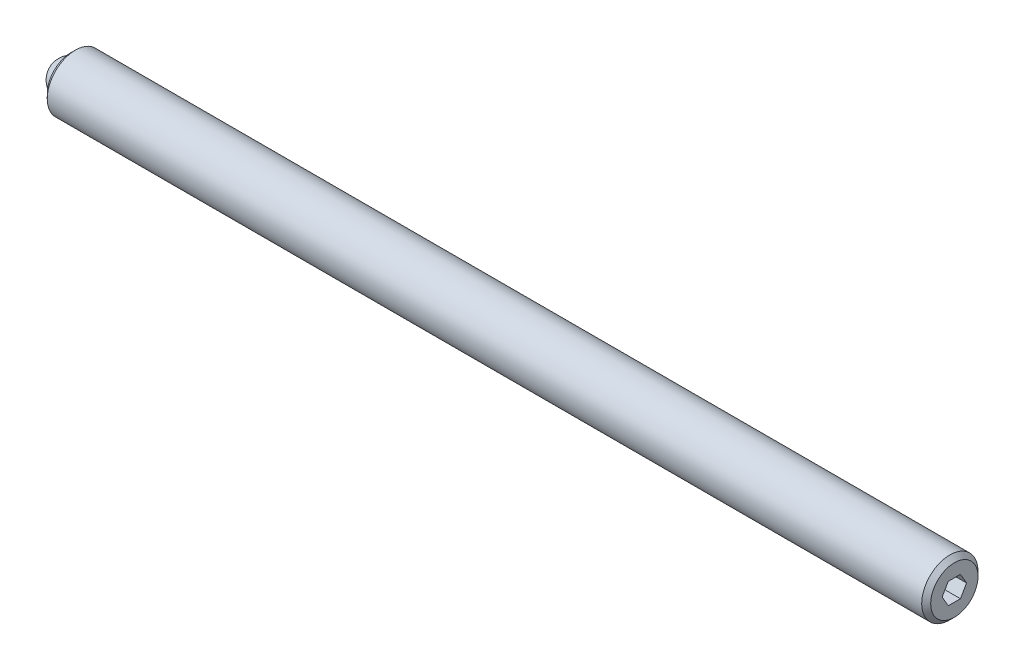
ISO-10303-21;
HEADER;
FILE_DESCRIPTION(('STEP AP214'),'2;1');
FILE_NAME('part.step','',(''),(''),'','','');
FILE_SCHEMA(('AUTOMOTIVE_DESIGN { 1 0 10303 214 1 1 1 1 }'));
ENDSEC;
DATA;
#1=APPLICATION_CONTEXT('core data for automotive mechanical design processes');
#2=APPLICATION_PROTOCOL_DEFINITION('international standard','automotive_design',2000,#1);
#3=PRODUCT_CONTEXT('',#1,'mechanical');
#4=PRODUCT('Part','Part','',(#3));
#5=PRODUCT_RELATED_PRODUCT_CATEGORY('part','',(#4));
#6=PRODUCT_DEFINITION_FORMATION('','',#4);
#7=PRODUCT_DEFINITION_CONTEXT('part definition',#1,'design');
#8=PRODUCT_DEFINITION('design','',#6,#7);
#9=PRODUCT_DEFINITION_SHAPE('','',#8);
#10=(LENGTH_UNIT() NAMED_UNIT(*) SI_UNIT(.MILLI.,.METRE.));
#11=(NAMED_UNIT(*) PLANE_ANGLE_UNIT() SI_UNIT($,.RADIAN.));
#12=(NAMED_UNIT(*) SI_UNIT($,.STERADIAN.) SOLID_ANGLE_UNIT());
#13=UNCERTAINTY_MEASURE_WITH_UNIT(LENGTH_MEASURE(1.E-05),#10,'distance_accuracy_value','');
#14=(GEOMETRIC_REPRESENTATION_CONTEXT(3) GLOBAL_UNCERTAINTY_ASSIGNED_CONTEXT((#13)) GLOBAL_UNIT_ASSIGNED_CONTEXT((#10,
#11,#12)) REPRESENTATION_CONTEXT('',''));
#15=CARTESIAN_POINT('',(0.,0.,0.));
#16=DIRECTION('',(0.,0.,1.));
#17=DIRECTION('',(1.,0.,0.));
#18=AXIS2_PLACEMENT_3D('',#15,#16,#17);
#19=CARTESIAN_POINT('',(0.,0.,0.));
#20=DIRECTION('',(0.,-1.,0.));
#21=DIRECTION('',(0.,0.,1.));
#22=AXIS2_PLACEMENT_3D('',#19,#20,#21);
#23=SPHERICAL_SURFACE('',#22,1.984375);
#24=CARTESIAN_POINT('',(0.,-1.984375,0.));
#25=VERTEX_POINT('',#24);
#26=VERTEX_LOOP('',#25);
#27=FACE_BOUND('',#26,.T.);
#28=ADVANCED_FACE('F41',(#27),#23,.T.);
#29=CLOSED_SHELL('',(#28));
#30=MANIFOLD_SOLID_BREP('B2',#29);
#31=CARTESIAN_POINT('',(99.615625,0.,0.));
#32=DIRECTION('',(-1.,0.,0.));
#33=DIRECTION('',(0.,0.,1.));
#34=AXIS2_PLACEMENT_3D('',#31,#32,#33);
#35=CYLINDRICAL_SURFACE('',#34,3.175);
#36=CARTESIAN_POINT('',(99.107625,0.,0.));
#37=DIRECTION('',(1.,0.,0.));
#38=DIRECTION('',(0.,0.,-1.));
#39=AXIS2_PLACEMENT_3D('',#36,#37,#38);
#40=CIRCLE('',#39,3.175);
#41=CARTESIAN_POINT('',(99.107625,0.,3.175));
#42=VERTEX_POINT('',#41);
#43=EDGE_CURVE('E39',#42,#42,#40,.F.);
#44=CARTESIAN_POINT('',(0.508000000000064,0.,0.));
#45=DIRECTION('',(1.,0.,0.));
#46=DIRECTION('',(0.,0.,-1.));
#47=AXIS2_PLACEMENT_3D('',#44,#45,#46);
#48=CIRCLE('',#47,3.175);
#49=CARTESIAN_POINT('',(0.508000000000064,0.,3.175));
#50=VERTEX_POINT('',#49);
#51=EDGE_CURVE('E157',#50,#50,#48,.T.);
#52=CARTESIAN_POINT('',(99.107625,0.,3.175));
#53=CARTESIAN_POINT('',(98.0805455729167,0.,3.175));
#54=CARTESIAN_POINT('',(97.0534661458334,0.,3.175));
#55=CARTESIAN_POINT('',(94.9993072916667,0.,3.175));
#56=CARTESIAN_POINT('',(93.9722278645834,0.,3.175));
#57=CARTESIAN_POINT('',(91.9180690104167,0.,3.175));
#58=CARTESIAN_POINT('',(90.8909895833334,0.,3.175));
#59=CARTESIAN_POINT('',(88.8368307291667,0.,3.175));
#60=CARTESIAN_POINT('',(87.8097513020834,0.,3.175));
#61=CARTESIAN_POINT('',(85.7555924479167,0.,3.175));
#62=CARTESIAN_POINT('',(84.7285130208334,0.,3.175));
#63=CARTESIAN_POINT('',(82.6743541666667,0.,3.175));
#64=CARTESIAN_POINT('',(81.6472747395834,0.,3.175));
#65=CARTESIAN_POINT('',(79.5931158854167,0.,3.175));
#66=CARTESIAN_POINT('',(78.5660364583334,0.,3.175));
#67=CARTESIAN_POINT('',(76.5118776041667,0.,3.175));
#68=CARTESIAN_POINT('',(75.4847981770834,0.,3.175));
#69=CARTESIAN_POINT('',(73.4306393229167,0.,3.175));
#70=CARTESIAN_POINT('',(72.4035598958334,0.,3.175));
#71=CARTESIAN_POINT('',(70.3494010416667,0.,3.175));
#72=CARTESIAN_POINT('',(69.3223216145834,0.,3.175));
#73=CARTESIAN_POINT('',(67.2681627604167,0.,3.175));
#74=CARTESIAN_POINT('',(66.2410833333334,0.,3.175));
#75=CARTESIAN_POINT('',(64.1869244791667,0.,3.175));
#76=CARTESIAN_POINT('',(63.1598450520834,0.,3.175));
#77=CARTESIAN_POINT('',(61.1056861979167,0.,3.175));
#78=CARTESIAN_POINT('',(60.0786067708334,0.,3.175));
#79=CARTESIAN_POINT('',(58.0244479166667,0.,3.175));
#80=CARTESIAN_POINT('',(56.9973684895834,0.,3.175));
#81=CARTESIAN_POINT('',(54.9432096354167,0.,3.175));
#82=CARTESIAN_POINT('',(53.9161302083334,0.,3.175));
#83=CARTESIAN_POINT('',(51.8619713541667,0.,3.175));
#84=CARTESIAN_POINT('',(50.8348919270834,0.,3.175));
#85=CARTESIAN_POINT('',(48.7807330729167,0.,3.175));
#86=CARTESIAN_POINT('',(47.7536536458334,0.,3.175));
#87=CARTESIAN_POINT('',(45.6994947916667,0.,3.175));
#88=CARTESIAN_POINT('',(44.6724153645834,0.,3.175));
#89=CARTESIAN_POINT('',(42.6182565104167,0.,3.175));
#90=CARTESIAN_POINT('',(41.5911770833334,0.,3.175));
#91=CARTESIAN_POINT('',(39.5370182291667,0.,3.175));
#92=CARTESIAN_POINT('',(38.5099388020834,0.,3.175));
#93=CARTESIAN_POINT('',(36.4557799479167,0.,3.175));
#94=CARTESIAN_POINT('',(35.4287005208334,0.,3.175));
#95=CARTESIAN_POINT('',(33.3745416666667,0.,3.175));
#96=CARTESIAN_POINT('',(32.3474622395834,0.,3.175));
#97=CARTESIAN_POINT('',(30.2933033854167,0.,3.175));
#98=CARTESIAN_POINT('',(29.2662239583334,0.,3.175));
#99=CARTESIAN_POINT('',(27.2120651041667,0.,3.175));
#100=CARTESIAN_POINT('',(26.1849856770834,0.,3.175));
#101=CARTESIAN_POINT('',(24.1308268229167,0.,3.175));
#102=CARTESIAN_POINT('',(23.1037473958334,0.,3.175));
#103=CARTESIAN_POINT('',(21.0495885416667,0.,3.175));
#104=CARTESIAN_POINT('',(20.0225091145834,0.,3.175));
#105=CARTESIAN_POINT('',(17.9683502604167,0.,3.175));
#106=CARTESIAN_POINT('',(16.9412708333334,0.,3.175));
#107=CARTESIAN_POINT('',(14.8871119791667,0.,3.175));
#108=CARTESIAN_POINT('',(13.8600325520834,0.,3.175));
#109=CARTESIAN_POINT('',(11.8058736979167,0.,3.175));
#110=CARTESIAN_POINT('',(10.7787942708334,0.,3.175));
#111=CARTESIAN_POINT('',(8.72463541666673,0.,3.175));
#112=CARTESIAN_POINT('',(7.69755598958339,0.,3.175));
#113=CARTESIAN_POINT('',(5.64339713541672,0.,3.175));
#114=CARTESIAN_POINT('',(4.61631770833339,0.,3.175));
#115=CARTESIAN_POINT('',(2.56215885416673,0.,3.175));
#116=CARTESIAN_POINT('',(1.5350794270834,0.,3.175));
#117=CARTESIAN_POINT('',(0.508000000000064,0.,3.175));
#118=B_SPLINE_CURVE_WITH_KNOTS('',3,(#52,#53,#54,#55,#56,#57,#58,#59,#60,#61,#62,#63,#64,#65,
#66,#67,#68,#69,#70,#71,#72,#73,#74,#75,#76,#77,#78,#79,#80,#81,#82,#83,#84,#85,#86,#87,#88,#89,
#90,#91,#92,#93,#94,#95,#96,#97,#98,#99,#100,#101,#102,#103,#104,#105,#106,#107,#108,#109,#110,
#111,#112,#113,#114,#115,#116,#117),.UNSPECIFIED.,.F.,.F.,(4,2,2,2,2,2,2,2,2,2,2,2,2,2,2,2,2,2,
2,2,2,2,2,2,2,2,2,2,2,2,2,2,4),(0.,3.08123828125,6.16247656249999,9.24371484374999,12.324953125,
15.40619140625,18.4874296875,21.56866796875,24.64990625,27.73114453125,30.8123828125,
33.89362109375,36.974859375,40.05609765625,43.1373359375,46.21857421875,49.2998125,
52.38105078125,55.4622890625,58.54352734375,61.624765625,64.70600390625,67.7872421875,
70.86848046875,73.94971875,77.03095703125,80.1121953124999,83.19343359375,86.274671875,
89.3559101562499,92.4371484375,95.51838671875,98.599625),.UNSPECIFIED.);
#119=EDGE_CURVE('BSEAM54',#42,#50,#118,.T.);
#120=ORIENTED_EDGE('',*,*,#43,.T.);
#121=ORIENTED_EDGE('',*,*,#51,.T.);
#122=ORIENTED_EDGE('',*,*,#119,.T.);
#123=ORIENTED_EDGE('',*,*,#119,.F.);
#124=EDGE_LOOP('',(#120,#122,#121,#123));
#125=FACE_BOUND('',#124,.T.);
#126=ADVANCED_FACE('F54',(#125),#35,.T.);
#127=CARTESIAN_POINT('',(99.615625,0.,0.));
#128=DIRECTION('',(1.,0.,0.));
#129=DIRECTION('',(0.,0.,-1.));
#130=AXIS2_PLACEMENT_3D('',#127,#128,#129);
#131=PLANE('',#130);
#132=DIRECTION('',(0.,0.866025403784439,-0.5));
#133=VECTOR('',#132,1.);
#134=CARTESIAN_POINT('',(99.615625,-1.190625,-0.687407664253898));
#135=LINE('',#134,#133);
#136=CARTESIAN_POINT('',(99.615625,-1.190625,-0.687407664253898));
#137=VERTEX_POINT('',#136);
#138=CARTESIAN_POINT('',(99.615625,0.,-1.3748153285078));
#139=VERTEX_POINT('',#138);
#140=EDGE_CURVE('E69',#137,#139,#135,.T.);
#141=ORIENTED_EDGE('',*,*,#140,.F.);
#142=DIRECTION('',(0.,0.,-1.));
#143=VECTOR('',#142,1.);
#144=CARTESIAN_POINT('',(99.615625,-1.190625,0.687407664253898));
#145=LINE('',#144,#143);
#146=CARTESIAN_POINT('',(99.615625,-1.190625,0.687407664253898));
#147=VERTEX_POINT('',#146);
#148=EDGE_CURVE('E153',#147,#137,#145,.T.);
#149=ORIENTED_EDGE('',*,*,#148,.F.);
#150=DIRECTION('',(0.,-0.866025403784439,-0.5));
#151=VECTOR('',#150,1.);
#152=CARTESIAN_POINT('',(99.615625,0.,1.3748153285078));
#153=LINE('',#152,#151);
#154=CARTESIAN_POINT('',(99.615625,0.,1.3748153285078));
#155=VERTEX_POINT('',#154);
#156=EDGE_CURVE('E151',#155,#147,#153,.T.);
#157=ORIENTED_EDGE('',*,*,#156,.F.);
#158=DIRECTION('',(0.,-0.866025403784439,0.5));
#159=VECTOR('',#158,1.);
#160=CARTESIAN_POINT('',(99.615625,1.190625,0.687407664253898));
#161=LINE('',#160,#159);
#162=CARTESIAN_POINT('',(99.615625,1.190625,0.687407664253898));
#163=VERTEX_POINT('',#162);
#164=EDGE_CURVE('E117',#163,#155,#161,.T.);
#165=ORIENTED_EDGE('',*,*,#164,.F.);
#166=DIRECTION('',(0.,0.,1.));
#167=VECTOR('',#166,1.);
#168=CARTESIAN_POINT('',(99.615625,1.190625,-0.687407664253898));
#169=LINE('',#168,#167);
#170=CARTESIAN_POINT('',(99.615625,1.190625,-0.687407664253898));
#171=VERTEX_POINT('',#170);
#172=EDGE_CURVE('E147',#171,#163,#169,.T.);
#173=ORIENTED_EDGE('',*,*,#172,.F.);
#174=DIRECTION('',(0.,0.866025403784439,0.5));
#175=VECTOR('',#174,1.);
#176=CARTESIAN_POINT('',(99.615625,0.,-1.3748153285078));
#177=LINE('',#176,#175);
#178=EDGE_CURVE('E143',#139,#171,#177,.T.);
#179=ORIENTED_EDGE('',*,*,#178,.F.);
#180=EDGE_LOOP('',(#141,#149,#157,#165,#173,#179));
#181=FACE_BOUND('',#180,.T.);
#182=CARTESIAN_POINT('',(99.615625,0.,0.));
#183=DIRECTION('',(1.,0.,0.));
#184=DIRECTION('',(0.,0.,-1.));
#185=AXIS2_PLACEMENT_3D('',#182,#183,#184);
#186=CIRCLE('',#185,2.66700000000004);
#187=CARTESIAN_POINT('',(99.615625,0.,-2.66700000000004));
#188=VERTEX_POINT('',#187);
#189=EDGE_CURVE('E62',#188,#188,#186,.T.);
#190=ORIENTED_EDGE('',*,*,#189,.T.);
#191=EDGE_LOOP('',(#190));
#192=FACE_BOUND('',#191,.T.);
#193=ADVANCED_FACE('F170',(#181,#192),#131,.T.);
#194=CARTESIAN_POINT('',(0.,0.,0.));
#195=DIRECTION('',(1.,0.,0.));
#196=DIRECTION('',(0.,0.,-1.));
#197=AXIS2_PLACEMENT_3D('',#194,#195,#196);
#198=PLANE('',#197);
#199=CARTESIAN_POINT('',(0.,0.,0.));
#200=DIRECTION('',(-1.,0.,0.));
#201=DIRECTION('',(0.,0.,1.));
#202=AXIS2_PLACEMENT_3D('',#199,#200,#201);
#203=CIRCLE('',#202,1.9812);
#204=CARTESIAN_POINT('',(0.,0.,1.9812));
#205=VERTEX_POINT('',#204);
#206=EDGE_CURVE('E225',#205,#205,#203,.T.);
#207=ORIENTED_EDGE('',*,*,#206,.F.);
#208=EDGE_LOOP('',(#207));
#209=FACE_BOUND('',#208,.T.);
#210=CARTESIAN_POINT('',(0.,0.,0.));
#211=DIRECTION('',(1.,0.,0.));
#212=DIRECTION('',(0.,0.,-1.));
#213=AXIS2_PLACEMENT_3D('',#210,#211,#212);
#214=CIRCLE('',#213,2.66699999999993);
#215=CARTESIAN_POINT('',(0.,0.,-2.66699999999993));
#216=VERTEX_POINT('',#215);
#217=EDGE_CURVE('E165',#216,#216,#214,.F.);
#218=ORIENTED_EDGE('',*,*,#217,.T.);
#219=EDGE_LOOP('',(#218));
#220=FACE_BOUND('',#219,.T.);
#221=ADVANCED_FACE('F182',(#209,#220),#198,.F.);
#222=CARTESIAN_POINT('',(0.508000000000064,0.,0.));
#223=DIRECTION('',(1.,0.,0.));
#224=DIRECTION('',(0.,0.,-1.));
#225=AXIS2_PLACEMENT_3D('',#222,#223,#224);
#226=CONICAL_SURFACE('',#225,3.175,0.785398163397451);
#227=ORIENTED_EDGE('',*,*,#217,.F.);
#228=EDGE_LOOP('',(#227));
#229=FACE_BOUND('',#228,.T.);
#230=ORIENTED_EDGE('',*,*,#51,.F.);
#231=EDGE_LOOP('',(#230));
#232=FACE_BOUND('',#231,.T.);
#233=ADVANCED_FACE('F174',(#229,#232),#226,.T.);
#234=CARTESIAN_POINT('',(99.615625,0.,0.));
#235=DIRECTION('',(-1.,0.,0.));
#236=DIRECTION('',(0.,0.,1.));
#237=AXIS2_PLACEMENT_3D('',#234,#235,#236);
#238=CONICAL_SURFACE('',#237,2.66700000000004,0.785398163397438);
#239=ORIENTED_EDGE('',*,*,#43,.F.);
#240=EDGE_LOOP('',(#239));
#241=FACE_BOUND('',#240,.T.);
#242=ORIENTED_EDGE('',*,*,#189,.F.);
#243=EDGE_LOOP('',(#242));
#244=FACE_BOUND('',#243,.T.);
#245=ADVANCED_FACE('F56',(#241,#244),#238,.T.);
#246=CARTESIAN_POINT('',(97.329625,-1.190625,-0.687407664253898));
#247=DIRECTION('',(0.,-0.5,-0.866025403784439));
#248=DIRECTION('',(0.,0.866025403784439,-0.5));
#249=AXIS2_PLACEMENT_3D('',#246,#247,#248);
#250=PLANE('',#249);
#251=ORIENTED_EDGE('',*,*,#140,.T.);
#252=DIRECTION('',(1.,0.,0.));
#253=VECTOR('',#252,1.);
#254=CARTESIAN_POINT('',(97.329625,0.,-1.3748153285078));
#255=LINE('',#254,#253);
#256=CARTESIAN_POINT('',(97.329625,0.,-1.3748153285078));
#257=VERTEX_POINT('',#256);
#258=EDGE_CURVE('E99',#257,#139,#255,.T.);
#259=ORIENTED_EDGE('',*,*,#258,.F.);
#260=DIRECTION('',(0.,0.866025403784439,-0.5));
#261=VECTOR('',#260,1.);
#262=CARTESIAN_POINT('',(97.329625,-1.190625,-0.687407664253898));
#263=LINE('',#262,#261);
#264=CARTESIAN_POINT('',(97.329625,-1.190625,-0.687407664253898));
#265=VERTEX_POINT('',#264);
#266=EDGE_CURVE('E155',#265,#257,#263,.T.);
#267=ORIENTED_EDGE('',*,*,#266,.F.);
#268=DIRECTION('',(1.,0.,0.));
#269=VECTOR('',#268,1.);
#270=CARTESIAN_POINT('',(97.329625,-1.190625,-0.687407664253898));
#271=LINE('',#270,#269);
#272=EDGE_CURVE('E77',#265,#137,#271,.T.);
#273=ORIENTED_EDGE('',*,*,#272,.T.);
#274=EDGE_LOOP('',(#251,#259,#267,#273));
#275=FACE_BOUND('',#274,.T.);
#276=ADVANCED_FACE('F173',(#275),#250,.F.);
#277=CARTESIAN_POINT('',(97.329625,-1.190625,0.687407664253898));
#278=DIRECTION('',(0.,-1.,0.));
#279=DIRECTION('',(0.,0.,-1.));
#280=AXIS2_PLACEMENT_3D('',#277,#278,#279);
#281=PLANE('',#280);
#282=ORIENTED_EDGE('',*,*,#148,.T.);
#283=ORIENTED_EDGE('',*,*,#272,.F.);
#284=DIRECTION('',(0.,0.,-1.));
#285=VECTOR('',#284,1.);
#286=CARTESIAN_POINT('',(97.329625,-1.190625,0.687407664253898));
#287=LINE('',#286,#285);
#288=CARTESIAN_POINT('',(97.329625,-1.190625,0.687407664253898));
#289=VERTEX_POINT('',#288);
#290=EDGE_CURVE('E129',#289,#265,#287,.T.);
#291=ORIENTED_EDGE('',*,*,#290,.F.);
#292=DIRECTION('',(1.,0.,0.));
#293=VECTOR('',#292,1.);
#294=CARTESIAN_POINT('',(97.329625,-1.190625,0.687407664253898));
#295=LINE('',#294,#293);
#296=EDGE_CURVE('E121',#289,#147,#295,.T.);
#297=ORIENTED_EDGE('',*,*,#296,.T.);
#298=EDGE_LOOP('',(#282,#283,#291,#297));
#299=FACE_BOUND('',#298,.T.);
#300=ADVANCED_FACE('F180',(#299),#281,.F.);
#301=CARTESIAN_POINT('',(97.329625,0.,1.3748153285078));
#302=DIRECTION('',(0.,-0.5,0.866025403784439));
#303=DIRECTION('',(0.,-0.866025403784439,-0.5));
#304=AXIS2_PLACEMENT_3D('',#301,#302,#303);
#305=PLANE('',#304);
#306=ORIENTED_EDGE('',*,*,#156,.T.);
#307=ORIENTED_EDGE('',*,*,#296,.F.);
#308=DIRECTION('',(0.,-0.866025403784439,-0.5));
#309=VECTOR('',#308,1.);
#310=CARTESIAN_POINT('',(97.329625,0.,1.3748153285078));
#311=LINE('',#310,#309);
#312=CARTESIAN_POINT('',(97.329625,0.,1.3748153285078));
#313=VERTEX_POINT('',#312);
#314=EDGE_CURVE('E125',#313,#289,#311,.T.);
#315=ORIENTED_EDGE('',*,*,#314,.F.);
#316=DIRECTION('',(1.,0.,0.));
#317=VECTOR('',#316,1.);
#318=CARTESIAN_POINT('',(97.329625,0.,1.3748153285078));
#319=LINE('',#318,#317);
#320=EDGE_CURVE('E110',#313,#155,#319,.T.);
#321=ORIENTED_EDGE('',*,*,#320,.T.);
#322=EDGE_LOOP('',(#306,#307,#315,#321));
#323=FACE_BOUND('',#322,.T.);
#324=ADVANCED_FACE('F126',(#323),#305,.F.);
#325=CARTESIAN_POINT('',(97.329625,1.190625,0.687407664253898));
#326=DIRECTION('',(0.,0.5,0.866025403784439));
#327=DIRECTION('',(0.,-0.866025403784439,0.5));
#328=AXIS2_PLACEMENT_3D('',#325,#326,#327);
#329=PLANE('',#328);
#330=ORIENTED_EDGE('',*,*,#164,.T.);
#331=ORIENTED_EDGE('',*,*,#320,.F.);
#332=DIRECTION('',(0.,-0.866025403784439,0.5));
#333=VECTOR('',#332,1.);
#334=CARTESIAN_POINT('',(97.329625,1.190625,0.687407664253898));
#335=LINE('',#334,#333);
#336=CARTESIAN_POINT('',(97.329625,1.190625,0.687407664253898));
#337=VERTEX_POINT('',#336);
#338=EDGE_CURVE('E114',#337,#313,#335,.T.);
#339=ORIENTED_EDGE('',*,*,#338,.F.);
#340=DIRECTION('',(1.,0.,0.));
#341=VECTOR('',#340,1.);
#342=CARTESIAN_POINT('',(97.329625,1.190625,0.687407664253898));
#343=LINE('',#342,#341);
#344=EDGE_CURVE('E122',#337,#163,#343,.T.);
#345=ORIENTED_EDGE('',*,*,#344,.T.);
#346=EDGE_LOOP('',(#330,#331,#339,#345));
#347=FACE_BOUND('',#346,.T.);
#348=ADVANCED_FACE('F112',(#347),#329,.F.);
#349=CARTESIAN_POINT('',(97.329625,1.190625,-0.687407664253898));
#350=DIRECTION('',(0.,1.,0.));
#351=DIRECTION('',(0.,0.,1.));
#352=AXIS2_PLACEMENT_3D('',#349,#350,#351);
#353=PLANE('',#352);
#354=ORIENTED_EDGE('',*,*,#172,.T.);
#355=ORIENTED_EDGE('',*,*,#344,.F.);
#356=DIRECTION('',(0.,0.,1.));
#357=VECTOR('',#356,1.);
#358=CARTESIAN_POINT('',(97.329625,1.190625,-0.687407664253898));
#359=LINE('',#358,#357);
#360=CARTESIAN_POINT('',(97.329625,1.190625,-0.687407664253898));
#361=VERTEX_POINT('',#360);
#362=EDGE_CURVE('E135',#361,#337,#359,.T.);
#363=ORIENTED_EDGE('',*,*,#362,.F.);
#364=DIRECTION('',(1.,0.,0.));
#365=VECTOR('',#364,1.);
#366=CARTESIAN_POINT('',(97.329625,1.190625,-0.687407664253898));
#367=LINE('',#366,#365);
#368=EDGE_CURVE('E160',#361,#171,#367,.T.);
#369=ORIENTED_EDGE('',*,*,#368,.T.);
#370=EDGE_LOOP('',(#354,#355,#363,#369));
#371=FACE_BOUND('',#370,.T.);
#372=ADVANCED_FACE('F201',(#371),#353,.F.);
#373=CARTESIAN_POINT('',(97.329625,0.,-1.3748153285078));
#374=DIRECTION('',(0.,0.5,-0.866025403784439));
#375=DIRECTION('',(0.,0.866025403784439,0.5));
#376=AXIS2_PLACEMENT_3D('',#373,#374,#375);
#377=PLANE('',#376);
#378=ORIENTED_EDGE('',*,*,#178,.T.);
#379=ORIENTED_EDGE('',*,*,#368,.F.);
#380=DIRECTION('',(0.,0.866025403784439,0.5));
#381=VECTOR('',#380,1.);
#382=CARTESIAN_POINT('',(97.329625,0.,-1.3748153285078));
#383=LINE('',#382,#381);
#384=EDGE_CURVE('E137',#257,#361,#383,.T.);
#385=ORIENTED_EDGE('',*,*,#384,.F.);
#386=ORIENTED_EDGE('',*,*,#258,.T.);
#387=EDGE_LOOP('',(#378,#379,#385,#386));
#388=FACE_BOUND('',#387,.T.);
#389=ADVANCED_FACE('F198',(#388),#377,.F.);
#390=CARTESIAN_POINT('',(97.329625,0.,0.));
#391=DIRECTION('',(1.,0.,0.));
#392=DIRECTION('',(0.,0.,-1.));
#393=AXIS2_PLACEMENT_3D('',#390,#391,#392);
#394=PLANE('',#393);
#395=ORIENTED_EDGE('',*,*,#266,.T.);
#396=ORIENTED_EDGE('',*,*,#384,.T.);
#397=ORIENTED_EDGE('',*,*,#362,.T.);
#398=ORIENTED_EDGE('',*,*,#338,.T.);
#399=ORIENTED_EDGE('',*,*,#314,.T.);
#400=ORIENTED_EDGE('',*,*,#290,.T.);
#401=EDGE_LOOP('',(#395,#396,#397,#398,#399,#400));
#402=FACE_BOUND('',#401,.T.);
#403=ADVANCED_FACE('F132',(#402),#394,.T.);
#404=CARTESIAN_POINT('',(1.984375,0.,0.));
#405=DIRECTION('',(-1.,0.,0.));
#406=DIRECTION('',(0.,0.,1.));
#407=AXIS2_PLACEMENT_3D('',#404,#405,#406);
#408=CYLINDRICAL_SURFACE('',#407,1.9812);
#409=CARTESIAN_POINT('',(1.984375,0.,0.));
#410=DIRECTION('',(-1.,0.,0.));
#411=DIRECTION('',(0.,0.,1.));
#412=AXIS2_PLACEMENT_3D('',#409,#410,#411);
#413=CIRCLE('',#412,1.9812);
#414=CARTESIAN_POINT('',(1.984375,0.,1.9812));
#415=VERTEX_POINT('',#414);
#416=EDGE_CURVE('E144',#415,#415,#413,.T.);
#417=ORIENTED_EDGE('',*,*,#416,.F.);
#418=EDGE_LOOP('',(#417));
#419=FACE_BOUND('',#418,.T.);
#420=ORIENTED_EDGE('',*,*,#206,.T.);
#421=EDGE_LOOP('',(#420));
#422=FACE_BOUND('',#421,.T.);
#423=ADVANCED_FACE('F214',(#419,#422),#408,.F.);
#424=CARTESIAN_POINT('',(1.984375,0.,0.));
#425=DIRECTION('',(-1.,0.,0.));
#426=DIRECTION('',(0.,0.,1.));
#427=AXIS2_PLACEMENT_3D('',#424,#425,#426);
#428=PLANE('',#427);
#429=ORIENTED_EDGE('',*,*,#416,.T.);
#430=EDGE_LOOP('',(#429));
#431=FACE_BOUND('',#430,.T.);
#432=ADVANCED_FACE('F217',(#431),#428,.T.);
#433=CLOSED_SHELL('',(#126,#193,#221,#233,#245,#276,#300,#324,#348,#372,#389,#403,#423,#432));
#434=MANIFOLD_SOLID_BREP('B6',#433);
#435=ADVANCED_BREP_SHAPE_REPRESENTATION('',(#18,#30,#434),#14);
#436=SHAPE_DEFINITION_REPRESENTATION(#9,#435);
ENDSEC;
END-ISO-10303-21;
